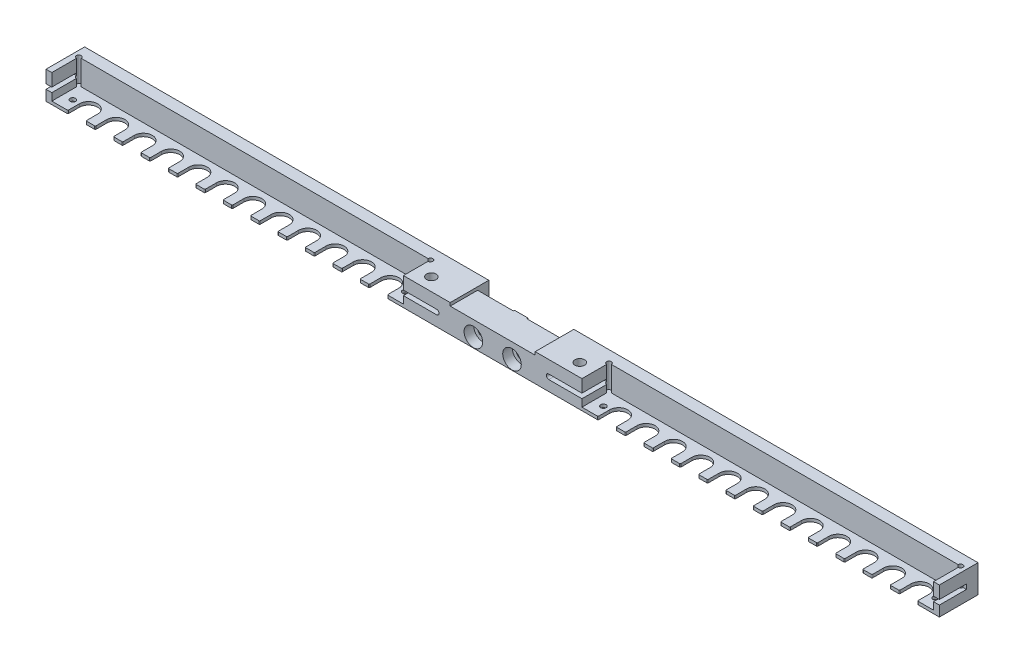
from build123d import *

# Parameters (mm, degrees)
SKETCH1_W                                           = 293.624
SKETCH1_H                                           = 12.7
EXTRUDE1_DEPTH                                      = 9.144
CUT_EXTRUDE1_DEPTH                                  = 8.128
CUT_EXTRUDE2_DEPTH                                  = 295.010897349
LPATTERN1_COUNT                                     = 12
LPATTERN1_PITCH                                     = 9.0043
SKETCH4_R                                           = 0.889
CUT_EXTRUDE3_DEPTH                                  = 295.010897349
LPATTERN2_COUNT                                     = 2
LPATTERN2_PITCH                                     = 109.22
MIRROR2_COPY_1_DEPTH                                = 295.010897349
MIRROR2_COPY_2_DEPTH                                = 295.010897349
MIRROR2_COPY_3_DEPTH                                = 295.010897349
MIRROR2_COPY_4_DEPTH                                = 295.010897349
MIRROR2_COPY_5_DEPTH                                = 295.010897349
MIRROR2_COPY_6_DEPTH                                = 295.010897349
MIRROR2_COPY_7_DEPTH                                = 295.010897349
MIRROR2_COPY_8_DEPTH                                = 295.010897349
MIRROR2_COPY_9_DEPTH                                = 295.010897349
MIRROR2_COPY_10_DEPTH                               = 295.010897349
MIRROR2_COPY_11_DEPTH                               = 295.010897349
MIRROR2_COPY_12_SKETCH_R                            = 0.889
MIRROR2_COPY_12_DEPTH                               = 295.010897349
SKETCH5_W                                           = 27.94
SKETCH5_H                                           = 12.7
CUT_EXTRUDE4_DEPTH                                  = 1.016
SKETCH6_W                                           = 27.94
SKETCH6_H                                           = 9.144
CUT_EXTRUDE5_DEPTH                                  = 3.302
SKETCH7_W                                           = 11.7475
SKETCH7_H                                           = 8.128
CUT_EXTRUDE6_DEPTH                                  = 0.381
CBORE_FOR_4_BINDING_HEAD_MACHINE_SCREW1_D           = 3.556
CBORE_FOR_4_BINDING_HEAD_MACHINE_SCREW1_CBORE_D     = 6.096
CBORE_FOR_4_BINDING_HEAD_MACHINE_SCREW1_CBORE_DEPTH = 3.175
CUT_EXTRUDE7_DEPTH                                  = 8.89
SKETCH11_R                                          = 1.5875
CUT_EXTRUDE8_DEPTH                                  = 295.040738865
FILLET2_R                                           = 0.254
FILLET3_R                                           = 0.254


with BuildPart() as part:
    # Sketch1 → Extrude1 (new body)
    with BuildSketch(Plane(origin=(0, 0, 0), x_dir=(1, 0, 0), z_dir=(0, 1, 0))):
        with Locations((146.812, -6.35)):
            Rectangle(SKETCH1_W, SKETCH1_H)
    extrude(amount=-EXTRUDE1_DEPTH)

    # Sketch2 → Cut-Extrude1 (cut)
    with BuildSketch(Plane(origin=(0, 0, 0), x_dir=(-1, 0, 0), z_dir=(0, 1, 0))):
        with BuildLine():
            Line((-1.905, 12.7), (-117.475, 12.7))
            Line((-117.475, 12.7), (-117.475, 4.5974))
            ThreePointArc((-117.475, 4.5974), (-118.03177588, 3.25322412), (-116.6876, 3.81))
            Line((-116.6876, 3.81), (-2.6924, 3.81))
            ThreePointArc((-2.6924, 3.81), (-1.34822412, 3.25322412), (-1.905, 4.5974))
            Line((-1.905, 4.5974), (-1.905, 12.7))
        make_face()
    cut_extrude1 = extrude(amount=-CUT_EXTRUDE1_DEPTH, mode=Mode.SUBTRACT)

    # Sketch3 → Cut-Extrude2 (cut, through all)
    with BuildSketch(Plane(origin=(0, -8.128, 0), x_dir=(-1, 0, 0), z_dir=(0, 1, 0))):
        with BuildLine():
            Line((-7.1882, 8.89), (-7.1882, 12.7))
            Line((-7.1882, 12.7), (-13.1318, 12.7))
            Line((-13.1318, 12.7), (-13.1318, 8.89))
            ThreePointArc((-13.1318, 8.89), (-10.16, 5.9182), (-7.1882, 8.89))
        make_face()
    cut_extrude2 = extrude(amount=-CUT_EXTRUDE2_DEPTH, mode=Mode.SUBTRACT)

    # LPattern1: Cut-Extrude2 ×12
    with Locations(*[(i * LPATTERN1_PITCH, 0, 0) for i in range(1, LPATTERN1_COUNT)]):
        add(cut_extrude2, mode=Mode.SUBTRACT)

    # Sketch4 → Cut-Extrude3 (cut, through all)
    with BuildSketch(Plane(origin=(0, -8.128, 0), x_dir=(-1, 0, 0), z_dir=(0, 1, 0))):
        with Locations(Location((-5.0038, 8.89, 0), (0, 0, 90))):
            Circle(SKETCH4_R)
    cut_extrude3 = extrude(amount=-CUT_EXTRUDE3_DEPTH, mode=Mode.SUBTRACT)

    # LPattern2: Cut-Extrude3 ×2
    with Locations(*[(i * LPATTERN2_PITCH, 0, 0) for i in range(1, LPATTERN2_COUNT)]):
        add(cut_extrude3, mode=Mode.SUBTRACT)

    # Mirror2: Cut-Extrude1, Cut-Extrude2, Cut-Extrude3 across plane
    add(cut_extrude1.mirror(Plane(origin=(146.812, 0, 0), x_dir=(0, 0, 1), z_dir=(1, 0, 0))), mode=Mode.SUBTRACT)
    add(cut_extrude2.mirror(Plane(origin=(146.812, 0, 0), x_dir=(0, 0, 1), z_dir=(1, 0, 0))), mode=Mode.SUBTRACT)
    add(cut_extrude3.mirror(Plane(origin=(146.812, 0, 0), x_dir=(0, 0, 1), z_dir=(1, 0, 0))), mode=Mode.SUBTRACT)

    # Mirror2 copy 1 sketch → Mirror2 copy 1 (cut, through all)
    with BuildSketch(Plane(origin=(284.6197, -8.128, 0), x_dir=(1, 0, 0), z_dir=(0, 1, 0))):
        with BuildLine():
            Line((-7.1882, -8.89), (-7.1882, -12.7))
            Line((-7.1882, -12.7), (-13.1318, -12.7))
            Line((-13.1318, -12.7), (-13.1318, -8.89))
            ThreePointArc((-13.1318, -8.89), (-10.16, -5.9182), (-7.1882, -8.89))
        make_face()
    extrude(amount=-MIRROR2_COPY_1_DEPTH, mode=Mode.SUBTRACT)

    # Mirror2 copy 2 sketch → Mirror2 copy 2 (cut, through all)
    with BuildSketch(Plane(origin=(275.6154, -8.128, 0), x_dir=(1, 0, 0), z_dir=(0, 1, 0))):
        with BuildLine():
            Line((-7.1882, -8.89), (-7.1882, -12.7))
            Line((-7.1882, -12.7), (-13.1318, -12.7))
            Line((-13.1318, -12.7), (-13.1318, -8.89))
            ThreePointArc((-13.1318, -8.89), (-10.16, -5.9182), (-7.1882, -8.89))
        make_face()
    extrude(amount=-MIRROR2_COPY_2_DEPTH, mode=Mode.SUBTRACT)

    # Mirror2 copy 3 sketch → Mirror2 copy 3 (cut, through all)
    with BuildSketch(Plane(origin=(266.6111, -8.128, 0), x_dir=(1, 0, 0), z_dir=(0, 1, 0))):
        with BuildLine():
            Line((-7.1882, -8.89), (-7.1882, -12.7))
            Line((-7.1882, -12.7), (-13.1318, -12.7))
            Line((-13.1318, -12.7), (-13.1318, -8.89))
            ThreePointArc((-13.1318, -8.89), (-10.16, -5.9182), (-7.1882, -8.89))
        make_face()
    extrude(amount=-MIRROR2_COPY_3_DEPTH, mode=Mode.SUBTRACT)

    # Mirror2 copy 4 sketch → Mirror2 copy 4 (cut, through all)
    with BuildSketch(Plane(origin=(257.6068, -8.128, 0), x_dir=(1, 0, 0), z_dir=(0, 1, 0))):
        with BuildLine():
            Line((-7.1882, -8.89), (-7.1882, -12.7))
            Line((-7.1882, -12.7), (-13.1318, -12.7))
            Line((-13.1318, -12.7), (-13.1318, -8.89))
            ThreePointArc((-13.1318, -8.89), (-10.16, -5.9182), (-7.1882, -8.89))
        make_face()
    extrude(amount=-MIRROR2_COPY_4_DEPTH, mode=Mode.SUBTRACT)

    # Mirror2 copy 5 sketch → Mirror2 copy 5 (cut, through all)
    with BuildSketch(Plane(origin=(248.6025, -8.128, 0), x_dir=(1, 0, 0), z_dir=(0, 1, 0))):
        with BuildLine():
            Line((-7.1882, -8.89), (-7.1882, -12.7))
            Line((-7.1882, -12.7), (-13.1318, -12.7))
            Line((-13.1318, -12.7), (-13.1318, -8.89))
            ThreePointArc((-13.1318, -8.89), (-10.16, -5.9182), (-7.1882, -8.89))
        make_face()
    extrude(amount=-MIRROR2_COPY_5_DEPTH, mode=Mode.SUBTRACT)

    # Mirror2 copy 6 sketch → Mirror2 copy 6 (cut, through all)
    with BuildSketch(Plane(origin=(239.5982, -8.128, 0), x_dir=(1, 0, 0), z_dir=(0, 1, 0))):
        with BuildLine():
            Line((-7.1882, -8.89), (-7.1882, -12.7))
            Line((-7.1882, -12.7), (-13.1318, -12.7))
            Line((-13.1318, -12.7), (-13.1318, -8.89))
            ThreePointArc((-13.1318, -8.89), (-10.16, -5.9182), (-7.1882, -8.89))
        make_face()
    extrude(amount=-MIRROR2_COPY_6_DEPTH, mode=Mode.SUBTRACT)

    # Mirror2 copy 7 sketch → Mirror2 copy 7 (cut, through all)
    with BuildSketch(Plane(origin=(230.5939, -8.128, 0), x_dir=(1, 0, 0), z_dir=(0, 1, 0))):
        with BuildLine():
            Line((-7.1882, -8.89), (-7.1882, -12.7))
            Line((-7.1882, -12.7), (-13.1318, -12.7))
            Line((-13.1318, -12.7), (-13.1318, -8.89))
            ThreePointArc((-13.1318, -8.89), (-10.16, -5.9182), (-7.1882, -8.89))
        make_face()
    extrude(amount=-MIRROR2_COPY_7_DEPTH, mode=Mode.SUBTRACT)

    # Mirror2 copy 8 sketch → Mirror2 copy 8 (cut, through all)
    with BuildSketch(Plane(origin=(221.5896, -8.128, 0), x_dir=(1, 0, 0), z_dir=(0, 1, 0))):
        with BuildLine():
            Line((-7.1882, -8.89), (-7.1882, -12.7))
            Line((-7.1882, -12.7), (-13.1318, -12.7))
            Line((-13.1318, -12.7), (-13.1318, -8.89))
            ThreePointArc((-13.1318, -8.89), (-10.16, -5.9182), (-7.1882, -8.89))
        make_face()
    extrude(amount=-MIRROR2_COPY_8_DEPTH, mode=Mode.SUBTRACT)

    # Mirror2 copy 9 sketch → Mirror2 copy 9 (cut, through all)
    with BuildSketch(Plane(origin=(212.5853, -8.128, 0), x_dir=(1, 0, 0), z_dir=(0, 1, 0))):
        with BuildLine():
            Line((-7.1882, -8.89), (-7.1882, -12.7))
            Line((-7.1882, -12.7), (-13.1318, -12.7))
            Line((-13.1318, -12.7), (-13.1318, -8.89))
            ThreePointArc((-13.1318, -8.89), (-10.16, -5.9182), (-7.1882, -8.89))
        make_face()
    extrude(amount=-MIRROR2_COPY_9_DEPTH, mode=Mode.SUBTRACT)

    # Mirror2 copy 10 sketch → Mirror2 copy 10 (cut, through all)
    with BuildSketch(Plane(origin=(203.581, -8.128, 0), x_dir=(1, 0, 0), z_dir=(0, 1, 0))):
        with BuildLine():
            Line((-7.1882, -8.89), (-7.1882, -12.7))
            Line((-7.1882, -12.7), (-13.1318, -12.7))
            Line((-13.1318, -12.7), (-13.1318, -8.89))
            ThreePointArc((-13.1318, -8.89), (-10.16, -5.9182), (-7.1882, -8.89))
        make_face()
    extrude(amount=-MIRROR2_COPY_10_DEPTH, mode=Mode.SUBTRACT)

    # Mirror2 copy 11 sketch → Mirror2 copy 11 (cut, through all)
    with BuildSketch(Plane(origin=(194.5767, -8.128, 0), x_dir=(1, 0, 0), z_dir=(0, 1, 0))):
        with BuildLine():
            Line((-7.1882, -8.89), (-7.1882, -12.7))
            Line((-7.1882, -12.7), (-13.1318, -12.7))
            Line((-13.1318, -12.7), (-13.1318, -8.89))
            ThreePointArc((-13.1318, -8.89), (-10.16, -5.9182), (-7.1882, -8.89))
        make_face()
    extrude(amount=-MIRROR2_COPY_11_DEPTH, mode=Mode.SUBTRACT)

    # Mirror2 copy 12 sketch → Mirror2 copy 12 (cut, through all)
    with BuildSketch(Plane(origin=(184.404, -8.128, 0), x_dir=(1, 0, 0), z_dir=(0, 1, 0))):
        with Locations((-5.0038, -8.89)):
            Circle(MIRROR2_COPY_12_SKETCH_R)
    extrude(amount=-MIRROR2_COPY_12_DEPTH, mode=Mode.SUBTRACT)

    # Sketch5 → Cut-Extrude4 (cut)
    with BuildSketch(Plane(origin=(0, 0, 0), x_dir=(-1, 0, 0), z_dir=(0, 1, 0))):
        with Locations((-146.812, 6.35)):
            Rectangle(SKETCH5_W, SKETCH5_H)
    extrude(amount=-CUT_EXTRUDE4_DEPTH, mode=Mode.SUBTRACT)

    # Sketch6 → Cut-Extrude5 (cut)
    with BuildSketch(Plane(origin=(0, 0, 0), x_dir=(-1, 0, 0), z_dir=(0, 0, -1))):
        with Locations((-146.812, -4.572)):
            Rectangle(SKETCH6_W, SKETCH6_H)
    extrude(amount=-CUT_EXTRUDE5_DEPTH, mode=Mode.SUBTRACT)

    # Sketch7 → Cut-Extrude6 (cut)
    with BuildSketch(Plane(origin=(0, 0, 3.302), x_dir=(-1, 0, 0), z_dir=(0, 0, -1))):
        with Locations((-154.90825, -5.08)):
            Rectangle(SKETCH7_W, SKETCH7_H)
    cut_extrude6 = extrude(amount=-CUT_EXTRUDE6_DEPTH, mode=Mode.SUBTRACT)

    # Mirror3: Cut-Extrude6 across plane
    add(cut_extrude6.mirror(Plane(origin=(146.812, 0, 0), x_dir=(0, 0, 1), z_dir=(1, 0, 0))), mode=Mode.SUBTRACT)

    # CBORE for _4 Binding Head Machine Screw1 (through all)
    with Locations(Plane.XY.offset(12.7)):
        with Locations((153.162, -5.969)):
            cbore_for_4_binding_head_machine_screw1 = CounterBoreHole(CBORE_FOR_4_BINDING_HEAD_MACHINE_SCREW1_D / 2, CBORE_FOR_4_BINDING_HEAD_MACHINE_SCREW1_CBORE_D / 2, CBORE_FOR_4_BINDING_HEAD_MACHINE_SCREW1_CBORE_DEPTH)

    # Mirror4: CBORE for _4 Binding Head Machine Screw1 across plane
    add(cbore_for_4_binding_head_machine_screw1.mirror(Plane(origin=(146.812, 0, 0), x_dir=(0, 0, 1), z_dir=(1, 0, 0))), mode=Mode.SUBTRACT)

    # Sketch10 → Cut-Extrude7 (cut)
    with BuildSketch(Plane.XY.offset(12.7)):
        with BuildLine():
            Line((0, -4.1402), (128.397, -4.1402))
            ThreePointArc((128.397, -4.1402), (129.1844, -4.9276), (128.397, -5.715))
            Line((128.397, -5.715), (0, -5.715))
            Line((0, -5.715), (0, -4.1402))
        make_face()
    cut_extrude7 = extrude(amount=-CUT_EXTRUDE7_DEPTH, mode=Mode.SUBTRACT)

    # Sketch11 → Cut-Extrude8 (cut, through all)
    with BuildSketch(Plane(origin=(0, 0, 0), x_dir=(-1, 0, 0), z_dir=(0, 1, 0))):
        with Locations(Location((-122.428, 8.4582, 0), (0, 0, 90))):
            Circle(SKETCH11_R)
    cut_extrude8 = extrude(amount=-CUT_EXTRUDE8_DEPTH, mode=Mode.SUBTRACT)

    # Mirror5: Cut-Extrude7, Cut-Extrude8 across plane
    add(cut_extrude7.mirror(Plane(origin=(146.812, 0, 0), x_dir=(0, 0, 1), z_dir=(1, 0, 0))), mode=Mode.SUBTRACT)
    add(cut_extrude8.mirror(Plane(origin=(146.812, 0, 0), x_dir=(0, 0, 1), z_dir=(1, 0, 0))), mode=Mode.SUBTRACT)

    # Fillet2
    fillet2_edges = [part.edges().sort_by_distance(p)[0] for p in [
        (58.1533, -8.636, 12.7),
        (52.2097, -8.636, 12.7),
        (67.1576, -8.636, 12.7),
        (61.214, -8.636, 12.7),
        (76.1619, -8.636, 12.7),
        (70.2183, -8.636, 12.7),
        (85.1662, -8.636, 12.7),
        (79.2226, -8.636, 12.7),
        (94.1705, -8.636, 12.7),
        (88.2269, -8.636, 12.7),
        (103.1748, -8.636, 12.7),
        (97.2312, -8.636, 12.7),
        (112.1791, -8.636, 12.7),
        (106.2355, -8.636, 12.7),
        (13.1318, -8.636, 12.7),
        (7.1882, -8.636, 12.7),
        (22.1361, -8.636, 12.7),
        (16.1925, -8.636, 12.7),
        (31.1404, -8.636, 12.7),
        (25.1968, -8.636, 12.7),
        (40.1447, -8.636, 12.7),
        (34.2011, -8.636, 12.7),
        (49.149, -8.636, 12.7),
        (43.2054, -8.636, 12.7),
    ]]
    fillet(fillet2_edges, radius=FILLET2_R)

    # Fillet3
    fillet3_edges = [part.edges().sort_by_distance(p)[0] for p in [
        (286.4358, -8.636, 12.7),
        (280.4922, -8.636, 12.7),
        (277.4315, -8.636, 12.7),
        (271.4879, -8.636, 12.7),
        (268.4272, -8.636, 12.7),
        (262.4836, -8.636, 12.7),
        (259.4229, -8.636, 12.7),
        (253.4793, -8.636, 12.7),
        (250.4186, -8.636, 12.7),
        (244.475, -8.636, 12.7),
        (241.4143, -8.636, 12.7),
        (235.4707, -8.636, 12.7),
        (232.41, -8.636, 12.7),
        (226.4664, -8.636, 12.7),
        (223.4057, -8.636, 12.7),
        (217.4621, -8.636, 12.7),
        (214.4014, -8.636, 12.7),
        (208.4578, -8.636, 12.7),
        (205.3971, -8.636, 12.7),
        (199.4535, -8.636, 12.7),
        (196.3928, -8.636, 12.7),
        (190.4492, -8.636, 12.7),
        (187.3885, -8.636, 12.7),
        (181.4449, -8.636, 12.7),
    ]]
    fillet(fillet3_edges, radius=FILLET3_R)


solid = part.part
